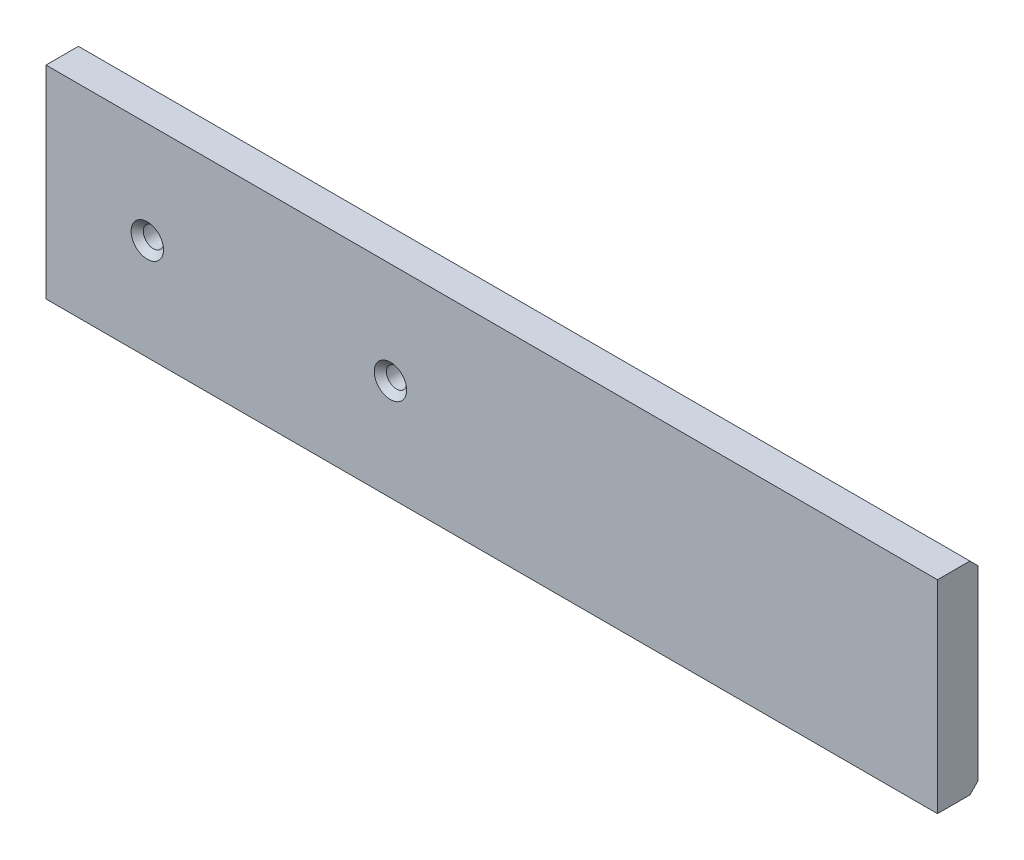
from build123d import *

# Parameters (mm, degrees)
ESQUISSE1_W                             = 220
ESQUISSE1_H                             = 50
BOSS_EXTRU_1_DEPTH                      = 10
ESQUISSE2_R                             = 2.5
ENL_V_MAT_EXTRU_1_DEPTH                 = 222.641602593
CHANFREIN1_SIZE                         = 2
CHANFREIN2_SIZE                         = 1.5
R_P_TITION_LIN_AIRE3_COUNT              = 2
R_P_TITION_LIN_AIRE3_PITCH              = 60
CHANFREIN2_OF_R_P_TITION_LIN_AIRE3_SIZE = 1.5


with BuildPart() as part:
    # Esquisse1 → Boss.-Extru.1 (new body)
    with BuildSketch(Plane.XY):
        with Locations((110, 0)):
            Rectangle(ESQUISSE1_W, ESQUISSE1_H)
    extrude(amount=BOSS_EXTRU_1_DEPTH)

    # Esquisse2 → Enl_v. mat.-Extru.1 (cut, through all)
    with BuildSketch(Plane(origin=(0, 0, 0), x_dir=(-1, 0, 0), z_dir=(0, 0, -1))):
        with Locations((-25, 0)):
            Circle(ESQUISSE2_R)
    enl_v_mat_extru_1 = extrude(amount=-ENL_V_MAT_EXTRU_1_DEPTH, mode=Mode.SUBTRACT)

    # Chanfrein1
    chanfrein1_edges = [part.edges().sort_by_distance(p)[0] for p in [
        (110, 25, 0),
        (110, -25, 0),
    ]]
    chamfer(chanfrein1_edges, length=CHANFREIN1_SIZE)

    # Chanfrein2
    chanfrein2_edges = [part.edges().sort_by_distance(p)[0] for p in [
        (27.5, 0, 10),
    ]]
    chamfer(chanfrein2_edges, length=CHANFREIN2_SIZE)

    # R_p_tition lin_aire3: Enl_v. mat.-Extru.1 ×2
    with Locations(*[(i * R_P_TITION_LIN_AIRE3_PITCH, 0, 0) for i in range(1, R_P_TITION_LIN_AIRE3_COUNT)]):
        add(enl_v_mat_extru_1, mode=Mode.SUBTRACT)

    # Chanfrein2 of R_p_tition lin_aire3
    chanfrein2_of_r_p_tition_lin_aire3_edges = [part.edges().sort_by_distance(p)[0] for p in [
        (87.5, 0, 10),
    ]]
    chamfer(chanfrein2_of_r_p_tition_lin_aire3_edges, length=CHANFREIN2_OF_R_P_TITION_LIN_AIRE3_SIZE)


solid = part.part
